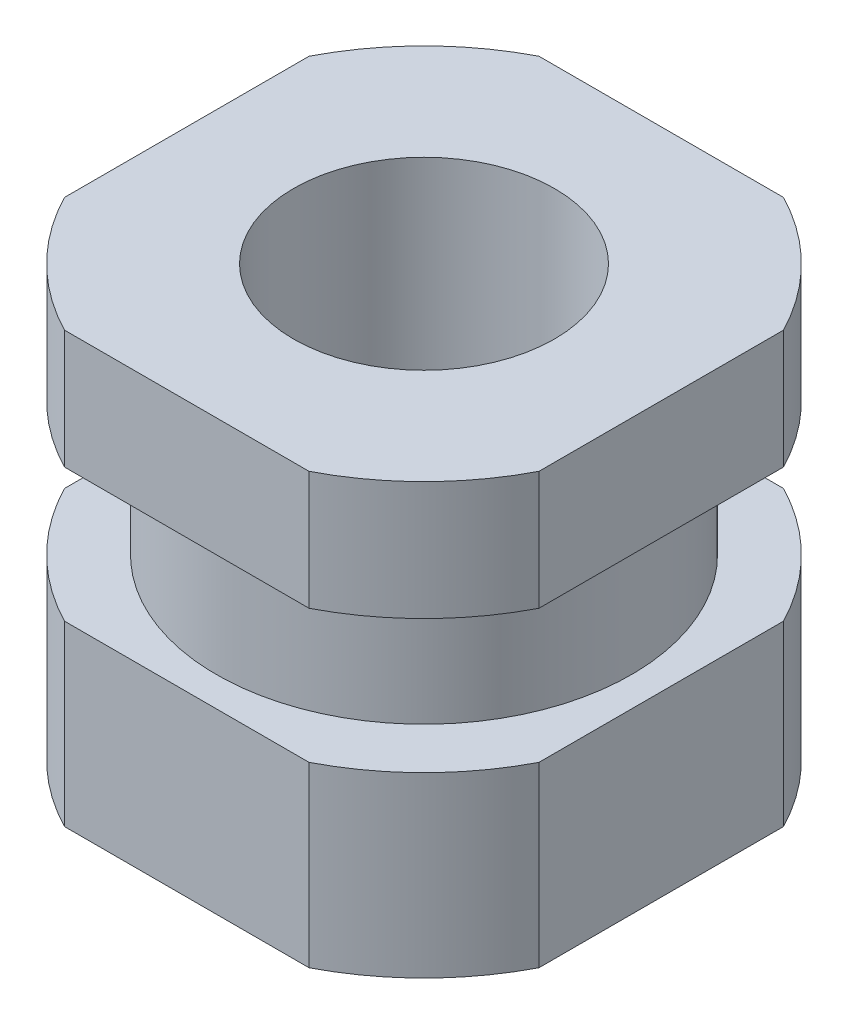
ISO-10303-21;
HEADER;
FILE_DESCRIPTION(('STEP AP214'),'2;1');
FILE_NAME('part.step','',(''),(''),'','','');
FILE_SCHEMA(('AUTOMOTIVE_DESIGN { 1 0 10303 214 1 1 1 1 }'));
ENDSEC;
DATA;
#1=APPLICATION_CONTEXT('core data for automotive mechanical design processes');
#2=APPLICATION_PROTOCOL_DEFINITION('international standard','automotive_design',2000,#1);
#3=PRODUCT_CONTEXT('',#1,'mechanical');
#4=PRODUCT('Part','Part','',(#3));
#5=PRODUCT_RELATED_PRODUCT_CATEGORY('part','',(#4));
#6=PRODUCT_DEFINITION_FORMATION('','',#4);
#7=PRODUCT_DEFINITION_CONTEXT('part definition',#1,'design');
#8=PRODUCT_DEFINITION('design','',#6,#7);
#9=PRODUCT_DEFINITION_SHAPE('','',#8);
#10=(LENGTH_UNIT() NAMED_UNIT(*) SI_UNIT(.MILLI.,.METRE.));
#11=(NAMED_UNIT(*) PLANE_ANGLE_UNIT() SI_UNIT($,.RADIAN.));
#12=(NAMED_UNIT(*) SI_UNIT($,.STERADIAN.) SOLID_ANGLE_UNIT());
#13=UNCERTAINTY_MEASURE_WITH_UNIT(LENGTH_MEASURE(1.E-05),#10,'distance_accuracy_value','');
#14=(GEOMETRIC_REPRESENTATION_CONTEXT(3) GLOBAL_UNCERTAINTY_ASSIGNED_CONTEXT((#13)) GLOBAL_UNIT_ASSIGNED_CONTEXT((#10,
#11,#12)) REPRESENTATION_CONTEXT('',''));
#15=CARTESIAN_POINT('',(0.,0.,0.));
#16=DIRECTION('',(0.,0.,1.));
#17=DIRECTION('',(1.,0.,0.));
#18=AXIS2_PLACEMENT_3D('',#15,#16,#17);
#19=CARTESIAN_POINT('',(37.,48.1125258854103,0.));
#20=DIRECTION('',(0.,1.,0.));
#21=DIRECTION('',(0.,0.,1.));
#22=AXIS2_PLACEMENT_3D('',#19,#20,#21);
#23=PLANE('',#22);
#24=CARTESIAN_POINT('',(37.,48.1125258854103,0.));
#25=DIRECTION('',(0.,1.,0.));
#26=DIRECTION('',(0.,0.,1.));
#27=AXIS2_PLACEMENT_3D('',#24,#25,#26);
#28=CIRCLE('',#27,4.4);
#29=CARTESIAN_POINT('',(37.,48.1125258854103,4.4));
#30=VERTEX_POINT('',#29);
#31=EDGE_CURVE('E164',#30,#30,#28,.T.);
#32=ORIENTED_EDGE('',*,*,#31,.T.);
#33=EDGE_LOOP('',(#32));
#34=FACE_BOUND('',#33,.T.);
#35=DIRECTION('',(0.,0.,-1.));
#36=VECTOR('',#35,1.);
#37=CARTESIAN_POINT('',(45.,48.1125258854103,0.));
#38=LINE('',#37,#36);
#39=CARTESIAN_POINT('',(45.,48.1125258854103,4.12310562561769));
#40=VERTEX_POINT('',#39);
#41=CARTESIAN_POINT('',(45.,48.1125258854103,-4.12310562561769));
#42=VERTEX_POINT('',#41);
#43=EDGE_CURVE('E173',#40,#42,#38,.T.);
#44=ORIENTED_EDGE('',*,*,#43,.F.);
#45=CARTESIAN_POINT('',(37.,48.1125258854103,0.));
#46=DIRECTION('',(0.,-1.,0.));
#47=DIRECTION('',(0.,0.,-1.));
#48=AXIS2_PLACEMENT_3D('',#45,#46,#47);
#49=CIRCLE('',#48,9.);
#50=CARTESIAN_POINT('',(41.1231056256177,48.1125258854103,8.));
#51=VERTEX_POINT('',#50);
#52=EDGE_CURVE('E245',#40,#51,#49,.T.);
#53=ORIENTED_EDGE('',*,*,#52,.T.);
#54=DIRECTION('',(1.,0.,0.));
#55=VECTOR('',#54,1.);
#56=CARTESIAN_POINT('',(37.,48.1125258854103,8.));
#57=LINE('',#56,#55);
#58=CARTESIAN_POINT('',(32.8768943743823,48.1125258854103,8.));
#59=VERTEX_POINT('',#58);
#60=EDGE_CURVE('E189',#59,#51,#57,.T.);
#61=ORIENTED_EDGE('',*,*,#60,.F.);
#62=CARTESIAN_POINT('',(29.,48.1125258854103,4.12310562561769));
#63=VERTEX_POINT('',#62);
#64=EDGE_CURVE('E306',#59,#63,#49,.T.);
#65=ORIENTED_EDGE('',*,*,#64,.T.);
#66=DIRECTION('',(0.,0.,1.));
#67=VECTOR('',#66,1.);
#68=CARTESIAN_POINT('',(29.,48.1125258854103,0.));
#69=LINE('',#68,#67);
#70=CARTESIAN_POINT('',(29.,48.1125258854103,-4.12310562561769));
#71=VERTEX_POINT('',#70);
#72=EDGE_CURVE('E203',#71,#63,#69,.T.);
#73=ORIENTED_EDGE('',*,*,#72,.F.);
#74=CARTESIAN_POINT('',(32.8768943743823,48.1125258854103,-8.));
#75=VERTEX_POINT('',#74);
#76=EDGE_CURVE('E246',#71,#75,#49,.T.);
#77=ORIENTED_EDGE('',*,*,#76,.T.);
#78=DIRECTION('',(-1.,0.,0.));
#79=VECTOR('',#78,1.);
#80=CARTESIAN_POINT('',(37.,48.1125258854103,-8.));
#81=LINE('',#80,#79);
#82=CARTESIAN_POINT('',(41.1231056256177,48.1125258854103,-8.));
#83=VERTEX_POINT('',#82);
#84=EDGE_CURVE('E216',#83,#75,#81,.T.);
#85=ORIENTED_EDGE('',*,*,#84,.F.);
#86=EDGE_CURVE('E138',#83,#42,#49,.T.);
#87=ORIENTED_EDGE('',*,*,#86,.T.);
#88=EDGE_LOOP('',(#44,#53,#61,#65,#73,#77,#85,#87));
#89=FACE_BOUND('',#88,.T.);
#90=ADVANCED_FACE('F16',(#34,#89),#23,.F.);
#91=CARTESIAN_POINT('',(37.,48.1125258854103,0.));
#92=DIRECTION('',(0.,-1.,0.));
#93=DIRECTION('',(0.,0.,-1.));
#94=AXIS2_PLACEMENT_3D('',#91,#92,#93);
#95=CYLINDRICAL_SURFACE('',#94,9.);
#96=DIRECTION('',(0.,-1.,0.));
#97=VECTOR('',#96,1.);
#98=CARTESIAN_POINT('',(45.,48.1125258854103,4.12310562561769));
#99=LINE('',#98,#97);
#100=CARTESIAN_POINT('',(45.,54.1125258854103,4.12310562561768));
#101=VERTEX_POINT('',#100);
#102=EDGE_CURVE('E177',#101,#40,#99,.T.);
#103=ORIENTED_EDGE('',*,*,#102,.F.);
#104=CARTESIAN_POINT('',(37.,54.1125258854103,0.));
#105=DIRECTION('',(0.,-1.,0.));
#106=DIRECTION('',(0.,0.,-1.));
#107=AXIS2_PLACEMENT_3D('',#104,#105,#106);
#108=CIRCLE('',#107,9.);
#109=CARTESIAN_POINT('',(41.1231056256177,54.1125258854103,8.));
#110=VERTEX_POINT('',#109);
#111=EDGE_CURVE('E250',#101,#110,#108,.T.);
#112=ORIENTED_EDGE('',*,*,#111,.T.);
#113=DIRECTION('',(0.,-1.,0.));
#114=VECTOR('',#113,1.);
#115=CARTESIAN_POINT('',(41.1231056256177,48.1125258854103,8.));
#116=LINE('',#115,#114);
#117=EDGE_CURVE('E193',#51,#110,#116,.F.);
#118=ORIENTED_EDGE('',*,*,#117,.F.);
#119=ORIENTED_EDGE('',*,*,#52,.F.);
#120=EDGE_LOOP('',(#103,#112,#118,#119));
#121=FACE_BOUND('',#120,.T.);
#122=ADVANCED_FACE('F285',(#121),#95,.T.);
#123=DIRECTION('',(0.,-1.,0.));
#124=VECTOR('',#123,1.);
#125=CARTESIAN_POINT('',(45.,48.1125258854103,-4.12310562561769));
#126=LINE('',#125,#124);
#127=CARTESIAN_POINT('',(45.,54.1125258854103,-4.12310562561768));
#128=VERTEX_POINT('',#127);
#129=EDGE_CURVE('E179',#42,#128,#126,.F.);
#130=ORIENTED_EDGE('',*,*,#129,.F.);
#131=ORIENTED_EDGE('',*,*,#86,.F.);
#132=DIRECTION('',(0.,-1.,0.));
#133=VECTOR('',#132,1.);
#134=CARTESIAN_POINT('',(41.1231056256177,48.1125258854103,-8.));
#135=LINE('',#134,#133);
#136=CARTESIAN_POINT('',(41.1231056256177,54.1125258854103,-8.));
#137=VERTEX_POINT('',#136);
#138=EDGE_CURVE('E218',#137,#83,#135,.T.);
#139=ORIENTED_EDGE('',*,*,#138,.F.);
#140=EDGE_CURVE('E247',#137,#128,#108,.T.);
#141=ORIENTED_EDGE('',*,*,#140,.T.);
#142=EDGE_LOOP('',(#130,#131,#139,#141));
#143=FACE_BOUND('',#142,.T.);
#144=ADVANCED_FACE('F290',(#143),#95,.T.);
#145=DIRECTION('',(0.,-1.,0.));
#146=VECTOR('',#145,1.);
#147=CARTESIAN_POINT('',(32.8768943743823,48.1125258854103,8.));
#148=LINE('',#147,#146);
#149=CARTESIAN_POINT('',(32.8768943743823,54.1125258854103,8.));
#150=VERTEX_POINT('',#149);
#151=EDGE_CURVE('E191',#150,#59,#148,.T.);
#152=ORIENTED_EDGE('',*,*,#151,.F.);
#153=CARTESIAN_POINT('',(29.,54.1125258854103,4.12310562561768));
#154=VERTEX_POINT('',#153);
#155=EDGE_CURVE('E317',#150,#154,#108,.T.);
#156=ORIENTED_EDGE('',*,*,#155,.T.);
#157=DIRECTION('',(0.,-1.,0.));
#158=VECTOR('',#157,1.);
#159=CARTESIAN_POINT('',(29.,48.1125258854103,4.12310562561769));
#160=LINE('',#159,#158);
#161=EDGE_CURVE('E38',#63,#154,#160,.F.);
#162=ORIENTED_EDGE('',*,*,#161,.F.);
#163=ORIENTED_EDGE('',*,*,#64,.F.);
#164=EDGE_LOOP('',(#152,#156,#162,#163));
#165=FACE_BOUND('',#164,.T.);
#166=ADVANCED_FACE('F326',(#165),#95,.T.);
#167=DIRECTION('',(0.,-1.,0.));
#168=VECTOR('',#167,1.);
#169=CARTESIAN_POINT('',(29.,48.1125258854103,-4.12310562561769));
#170=LINE('',#169,#168);
#171=CARTESIAN_POINT('',(29.,54.1125258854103,-4.12310562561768));
#172=VERTEX_POINT('',#171);
#173=EDGE_CURVE('E205',#172,#71,#170,.T.);
#174=ORIENTED_EDGE('',*,*,#173,.F.);
#175=CARTESIAN_POINT('',(32.8768943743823,54.1125258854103,-8.));
#176=VERTEX_POINT('',#175);
#177=EDGE_CURVE('E251',#172,#176,#108,.T.);
#178=ORIENTED_EDGE('',*,*,#177,.T.);
#179=DIRECTION('',(0.,-1.,0.));
#180=VECTOR('',#179,1.);
#181=CARTESIAN_POINT('',(32.8768943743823,48.1125258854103,-8.));
#182=LINE('',#181,#180);
#183=EDGE_CURVE('E30',#75,#176,#182,.F.);
#184=ORIENTED_EDGE('',*,*,#183,.F.);
#185=ORIENTED_EDGE('',*,*,#76,.F.);
#186=EDGE_LOOP('',(#174,#178,#184,#185));
#187=FACE_BOUND('',#186,.T.);
#188=ADVANCED_FACE('F292',(#187),#95,.T.);
#189=CARTESIAN_POINT('',(28.,54.1125258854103,0.));
#190=DIRECTION('',(0.,-1.,0.));
#191=DIRECTION('',(0.,0.,-1.));
#192=AXIS2_PLACEMENT_3D('',#189,#190,#191);
#193=PLANE('',#192);
#194=CARTESIAN_POINT('',(37.,54.1125258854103,0.));
#195=DIRECTION('',(0.,-1.,0.));
#196=DIRECTION('',(0.,0.,-1.));
#197=AXIS2_PLACEMENT_3D('',#194,#195,#196);
#198=CIRCLE('',#197,7.);
#199=CARTESIAN_POINT('',(37.,54.1125258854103,-7.));
#200=VERTEX_POINT('',#199);
#201=EDGE_CURVE('E252',#200,#200,#198,.T.);
#202=ORIENTED_EDGE('',*,*,#201,.T.);
#203=EDGE_LOOP('',(#202));
#204=FACE_BOUND('',#203,.T.);
#205=DIRECTION('',(0.,0.,1.));
#206=VECTOR('',#205,1.);
#207=CARTESIAN_POINT('',(45.,54.1125258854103,0.));
#208=LINE('',#207,#206);
#209=EDGE_CURVE('E181',#128,#101,#208,.T.);
#210=ORIENTED_EDGE('',*,*,#209,.F.);
#211=ORIENTED_EDGE('',*,*,#140,.F.);
#212=DIRECTION('',(1.,0.,0.));
#213=VECTOR('',#212,1.);
#214=CARTESIAN_POINT('',(28.,54.1125258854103,-8.));
#215=LINE('',#214,#213);
#216=EDGE_CURVE('E148',#176,#137,#215,.T.);
#217=ORIENTED_EDGE('',*,*,#216,.F.);
#218=ORIENTED_EDGE('',*,*,#177,.F.);
#219=DIRECTION('',(0.,0.,-1.));
#220=VECTOR('',#219,1.);
#221=CARTESIAN_POINT('',(29.,54.1125258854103,0.));
#222=LINE('',#221,#220);
#223=EDGE_CURVE('E208',#154,#172,#222,.T.);
#224=ORIENTED_EDGE('',*,*,#223,.F.);
#225=ORIENTED_EDGE('',*,*,#155,.F.);
#226=DIRECTION('',(-1.,0.,0.));
#227=VECTOR('',#226,1.);
#228=CARTESIAN_POINT('',(28.,54.1125258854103,8.));
#229=LINE('',#228,#227);
#230=EDGE_CURVE('E195',#110,#150,#229,.T.);
#231=ORIENTED_EDGE('',*,*,#230,.F.);
#232=ORIENTED_EDGE('',*,*,#111,.F.);
#233=EDGE_LOOP('',(#210,#211,#217,#218,#224,#225,#231,#232));
#234=FACE_BOUND('',#233,.T.);
#235=ADVANCED_FACE('F324',(#204,#234),#193,.F.);
#236=CARTESIAN_POINT('',(30.,58.6125258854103,0.));
#237=DIRECTION('',(0.,1.,0.));
#238=DIRECTION('',(0.,0.,1.));
#239=AXIS2_PLACEMENT_3D('',#236,#237,#238);
#240=PLANE('',#239);
#241=CARTESIAN_POINT('',(37.,58.6125258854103,0.));
#242=DIRECTION('',(0.,-1.,0.));
#243=DIRECTION('',(0.,0.,-1.));
#244=AXIS2_PLACEMENT_3D('',#241,#242,#243);
#245=CIRCLE('',#244,7.);
#246=CARTESIAN_POINT('',(37.,58.6125258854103,-7.));
#247=VERTEX_POINT('',#246);
#248=EDGE_CURVE('E255',#247,#247,#245,.T.);
#249=ORIENTED_EDGE('',*,*,#248,.F.);
#250=EDGE_LOOP('',(#249));
#251=FACE_BOUND('',#250,.T.);
#252=DIRECTION('',(0.,0.,-1.));
#253=VECTOR('',#252,1.);
#254=CARTESIAN_POINT('',(45.,58.6125258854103,0.));
#255=LINE('',#254,#253);
#256=CARTESIAN_POINT('',(45.,58.6125258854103,4.12310562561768));
#257=VERTEX_POINT('',#256);
#258=CARTESIAN_POINT('',(45.,58.6125258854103,-4.12310562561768));
#259=VERTEX_POINT('',#258);
#260=EDGE_CURVE('E185',#257,#259,#255,.T.);
#261=ORIENTED_EDGE('',*,*,#260,.F.);
#262=CARTESIAN_POINT('',(37.,58.6125258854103,0.));
#263=DIRECTION('',(0.,-1.,0.));
#264=DIRECTION('',(0.,0.,-1.));
#265=AXIS2_PLACEMENT_3D('',#262,#263,#264);
#266=CIRCLE('',#265,9.);
#267=CARTESIAN_POINT('',(41.1231056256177,58.6125258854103,8.));
#268=VERTEX_POINT('',#267);
#269=EDGE_CURVE('E257',#257,#268,#266,.T.);
#270=ORIENTED_EDGE('',*,*,#269,.T.);
#271=DIRECTION('',(1.,0.,0.));
#272=VECTOR('',#271,1.);
#273=CARTESIAN_POINT('',(30.,58.6125258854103,8.));
#274=LINE('',#273,#272);
#275=CARTESIAN_POINT('',(32.8768943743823,58.6125258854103,8.));
#276=VERTEX_POINT('',#275);
#277=EDGE_CURVE('E199',#276,#268,#274,.T.);
#278=ORIENTED_EDGE('',*,*,#277,.F.);
#279=CARTESIAN_POINT('',(29.,58.6125258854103,4.12310562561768));
#280=VERTEX_POINT('',#279);
#281=EDGE_CURVE('E159',#276,#280,#266,.T.);
#282=ORIENTED_EDGE('',*,*,#281,.T.);
#283=DIRECTION('',(0.,0.,1.));
#284=VECTOR('',#283,1.);
#285=CARTESIAN_POINT('',(29.,58.6125258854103,0.));
#286=LINE('',#285,#284);
#287=CARTESIAN_POINT('',(29.,58.6125258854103,-4.12310562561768));
#288=VERTEX_POINT('',#287);
#289=EDGE_CURVE('E212',#288,#280,#286,.T.);
#290=ORIENTED_EDGE('',*,*,#289,.F.);
#291=CARTESIAN_POINT('',(32.8768943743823,58.6125258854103,-8.));
#292=VERTEX_POINT('',#291);
#293=EDGE_CURVE('E154',#288,#292,#266,.T.);
#294=ORIENTED_EDGE('',*,*,#293,.T.);
#295=DIRECTION('',(-1.,0.,0.));
#296=VECTOR('',#295,1.);
#297=CARTESIAN_POINT('',(30.,58.6125258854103,-8.));
#298=LINE('',#297,#296);
#299=CARTESIAN_POINT('',(41.1231056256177,58.6125258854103,-8.));
#300=VERTEX_POINT('',#299);
#301=EDGE_CURVE('E149',#300,#292,#298,.T.);
#302=ORIENTED_EDGE('',*,*,#301,.F.);
#303=EDGE_CURVE('E147',#300,#259,#266,.T.);
#304=ORIENTED_EDGE('',*,*,#303,.T.);
#305=EDGE_LOOP('',(#261,#270,#278,#282,#290,#294,#302,#304));
#306=FACE_BOUND('',#305,.T.);
#307=ADVANCED_FACE('F228',(#251,#306),#240,.F.);
#308=CARTESIAN_POINT('',(37.,48.1125258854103,0.));
#309=DIRECTION('',(0.,-1.,0.));
#310=DIRECTION('',(0.,0.,-1.));
#311=AXIS2_PLACEMENT_3D('',#308,#309,#310);
#312=CYLINDRICAL_SURFACE('',#311,9.);
#313=DIRECTION('',(0.,-1.,0.));
#314=VECTOR('',#313,1.);
#315=CARTESIAN_POINT('',(45.,48.1125258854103,4.12310562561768));
#316=LINE('',#315,#314);
#317=CARTESIAN_POINT('',(45.,62.6125258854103,4.12310562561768));
#318=VERTEX_POINT('',#317);
#319=EDGE_CURVE('E183',#318,#257,#316,.T.);
#320=ORIENTED_EDGE('',*,*,#319,.F.);
#321=CARTESIAN_POINT('',(37.,62.6125258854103,0.));
#322=DIRECTION('',(0.,-1.,0.));
#323=DIRECTION('',(0.,0.,-1.));
#324=AXIS2_PLACEMENT_3D('',#321,#322,#323);
#325=CIRCLE('',#324,9.);
#326=CARTESIAN_POINT('',(41.1231056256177,62.6125258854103,8.));
#327=VERTEX_POINT('',#326);
#328=EDGE_CURVE('E155',#318,#327,#325,.T.);
#329=ORIENTED_EDGE('',*,*,#328,.T.);
#330=DIRECTION('',(0.,-1.,0.));
#331=VECTOR('',#330,1.);
#332=CARTESIAN_POINT('',(41.1231056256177,48.1125258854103,8.));
#333=LINE('',#332,#331);
#334=EDGE_CURVE('E201',#268,#327,#333,.F.);
#335=ORIENTED_EDGE('',*,*,#334,.F.);
#336=ORIENTED_EDGE('',*,*,#269,.F.);
#337=EDGE_LOOP('',(#320,#329,#335,#336));
#338=FACE_BOUND('',#337,.T.);
#339=ADVANCED_FACE('F263',(#338),#312,.T.);
#340=DIRECTION('',(0.,-1.,0.));
#341=VECTOR('',#340,1.);
#342=CARTESIAN_POINT('',(45.,48.1125258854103,-4.12310562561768));
#343=LINE('',#342,#341);
#344=CARTESIAN_POINT('',(45.,62.6125258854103,-4.12310562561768));
#345=VERTEX_POINT('',#344);
#346=EDGE_CURVE('E187',#259,#345,#343,.F.);
#347=ORIENTED_EDGE('',*,*,#346,.F.);
#348=ORIENTED_EDGE('',*,*,#303,.F.);
#349=DIRECTION('',(0.,-1.,0.));
#350=VECTOR('',#349,1.);
#351=CARTESIAN_POINT('',(41.1231056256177,48.1125258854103,-8.));
#352=LINE('',#351,#350);
#353=CARTESIAN_POINT('',(41.1231056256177,62.6125258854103,-8.));
#354=VERTEX_POINT('',#353);
#355=EDGE_CURVE('E129',#354,#300,#352,.T.);
#356=ORIENTED_EDGE('',*,*,#355,.F.);
#357=EDGE_CURVE('E145',#354,#345,#325,.T.);
#358=ORIENTED_EDGE('',*,*,#357,.T.);
#359=EDGE_LOOP('',(#347,#348,#356,#358));
#360=FACE_BOUND('',#359,.T.);
#361=ADVANCED_FACE('F144',(#360),#312,.T.);
#362=DIRECTION('',(0.,-1.,0.));
#363=VECTOR('',#362,1.);
#364=CARTESIAN_POINT('',(32.8768943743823,48.1125258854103,8.));
#365=LINE('',#364,#363);
#366=CARTESIAN_POINT('',(32.8768943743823,62.6125258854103,8.));
#367=VERTEX_POINT('',#366);
#368=EDGE_CURVE('E197',#367,#276,#365,.T.);
#369=ORIENTED_EDGE('',*,*,#368,.F.);
#370=CARTESIAN_POINT('',(29.,62.6125258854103,4.12310562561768));
#371=VERTEX_POINT('',#370);
#372=EDGE_CURVE('E162',#367,#371,#325,.T.);
#373=ORIENTED_EDGE('',*,*,#372,.T.);
#374=DIRECTION('',(0.,-1.,0.));
#375=VECTOR('',#374,1.);
#376=CARTESIAN_POINT('',(29.,48.1125258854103,4.12310562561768));
#377=LINE('',#376,#375);
#378=EDGE_CURVE('E214',#280,#371,#377,.F.);
#379=ORIENTED_EDGE('',*,*,#378,.F.);
#380=ORIENTED_EDGE('',*,*,#281,.F.);
#381=EDGE_LOOP('',(#369,#373,#379,#380));
#382=FACE_BOUND('',#381,.T.);
#383=ADVANCED_FACE('F238',(#382),#312,.T.);
#384=DIRECTION('',(0.,-1.,0.));
#385=VECTOR('',#384,1.);
#386=CARTESIAN_POINT('',(29.,48.1125258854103,-4.12310562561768));
#387=LINE('',#386,#385);
#388=CARTESIAN_POINT('',(29.,62.6125258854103,-4.12310562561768));
#389=VERTEX_POINT('',#388);
#390=EDGE_CURVE('E210',#389,#288,#387,.T.);
#391=ORIENTED_EDGE('',*,*,#390,.F.);
#392=CARTESIAN_POINT('',(32.8768943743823,62.6125258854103,-8.));
#393=VERTEX_POINT('',#392);
#394=EDGE_CURVE('E157',#389,#393,#325,.T.);
#395=ORIENTED_EDGE('',*,*,#394,.T.);
#396=DIRECTION('',(0.,-1.,0.));
#397=VECTOR('',#396,1.);
#398=CARTESIAN_POINT('',(32.8768943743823,48.1125258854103,-8.));
#399=LINE('',#398,#397);
#400=EDGE_CURVE('E132',#292,#393,#399,.F.);
#401=ORIENTED_EDGE('',*,*,#400,.F.);
#402=ORIENTED_EDGE('',*,*,#293,.F.);
#403=EDGE_LOOP('',(#391,#395,#401,#402));
#404=FACE_BOUND('',#403,.T.);
#405=ADVANCED_FACE('F225',(#404),#312,.T.);
#406=CARTESIAN_POINT('',(28.,62.6125258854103,0.));
#407=DIRECTION('',(0.,-1.,0.));
#408=DIRECTION('',(0.,0.,-1.));
#409=AXIS2_PLACEMENT_3D('',#406,#407,#408);
#410=PLANE('',#409);
#411=CARTESIAN_POINT('',(37.,62.6125258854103,0.));
#412=DIRECTION('',(0.,1.,0.));
#413=DIRECTION('',(0.,0.,1.));
#414=AXIS2_PLACEMENT_3D('',#411,#412,#413);
#415=CIRCLE('',#414,4.4);
#416=CARTESIAN_POINT('',(37.,62.6125258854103,4.4));
#417=VERTEX_POINT('',#416);
#418=EDGE_CURVE('E169',#417,#417,#415,.T.);
#419=ORIENTED_EDGE('',*,*,#418,.F.);
#420=EDGE_LOOP('',(#419));
#421=FACE_BOUND('',#420,.T.);
#422=DIRECTION('',(0.,0.,1.));
#423=VECTOR('',#422,1.);
#424=CARTESIAN_POINT('',(45.,62.6125258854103,0.));
#425=LINE('',#424,#423);
#426=EDGE_CURVE('E11',#345,#318,#425,.T.);
#427=ORIENTED_EDGE('',*,*,#426,.F.);
#428=ORIENTED_EDGE('',*,*,#357,.F.);
#429=DIRECTION('',(1.,0.,0.));
#430=VECTOR('',#429,1.);
#431=CARTESIAN_POINT('',(28.,62.6125258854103,-8.));
#432=LINE('',#431,#430);
#433=EDGE_CURVE('E126',#393,#354,#432,.T.);
#434=ORIENTED_EDGE('',*,*,#433,.F.);
#435=ORIENTED_EDGE('',*,*,#394,.F.);
#436=DIRECTION('',(0.,0.,-1.));
#437=VECTOR('',#436,1.);
#438=CARTESIAN_POINT('',(29.,62.6125258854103,0.));
#439=LINE('',#438,#437);
#440=EDGE_CURVE('E137',#371,#389,#439,.T.);
#441=ORIENTED_EDGE('',*,*,#440,.F.);
#442=ORIENTED_EDGE('',*,*,#372,.F.);
#443=DIRECTION('',(-1.,0.,0.));
#444=VECTOR('',#443,1.);
#445=CARTESIAN_POINT('',(28.,62.6125258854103,8.));
#446=LINE('',#445,#444);
#447=EDGE_CURVE('E23',#327,#367,#446,.T.);
#448=ORIENTED_EDGE('',*,*,#447,.F.);
#449=ORIENTED_EDGE('',*,*,#328,.F.);
#450=EDGE_LOOP('',(#427,#428,#434,#435,#441,#442,#448,#449));
#451=FACE_BOUND('',#450,.T.);
#452=ADVANCED_FACE('F152',(#421,#451),#410,.F.);
#453=CARTESIAN_POINT('',(37.,48.1125258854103,0.));
#454=DIRECTION('',(0.,-1.,0.));
#455=DIRECTION('',(0.,0.,-1.));
#456=AXIS2_PLACEMENT_3D('',#453,#454,#455);
#457=CYLINDRICAL_SURFACE('',#456,7.);
#458=ORIENTED_EDGE('',*,*,#201,.F.);
#459=EDGE_LOOP('',(#458));
#460=FACE_BOUND('',#459,.T.);
#461=ORIENTED_EDGE('',*,*,#248,.T.);
#462=EDGE_LOOP('',(#461));
#463=FACE_BOUND('',#462,.T.);
#464=ADVANCED_FACE('F338',(#460,#463),#457,.T.);
#465=CARTESIAN_POINT('',(37.,62.6125258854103,0.));
#466=DIRECTION('',(0.,1.,0.));
#467=DIRECTION('',(0.,0.,1.));
#468=AXIS2_PLACEMENT_3D('',#465,#466,#467);
#469=CYLINDRICAL_SURFACE('',#468,4.4);
#470=ORIENTED_EDGE('',*,*,#31,.F.);
#471=EDGE_LOOP('',(#470));
#472=FACE_BOUND('',#471,.T.);
#473=ORIENTED_EDGE('',*,*,#418,.T.);
#474=EDGE_LOOP('',(#473));
#475=FACE_BOUND('',#474,.T.);
#476=ADVANCED_FACE('F341',(#472,#475),#469,.F.);
#477=CARTESIAN_POINT('',(29.,-37.3874741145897,-8.));
#478=DIRECTION('',(0.,0.,-1.));
#479=DIRECTION('',(-1.,0.,0.));
#480=AXIS2_PLACEMENT_3D('',#477,#478,#479);
#481=PLANE('',#480);
#482=ORIENTED_EDGE('',*,*,#355,.T.);
#483=ORIENTED_EDGE('',*,*,#301,.T.);
#484=ORIENTED_EDGE('',*,*,#400,.T.);
#485=ORIENTED_EDGE('',*,*,#433,.T.);
#486=EDGE_LOOP('',(#482,#483,#484,#485));
#487=FACE_BOUND('',#486,.T.);
#488=ADVANCED_FACE('F128',(#487),#481,.T.);
#489=CARTESIAN_POINT('',(29.,-37.3874741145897,8.));
#490=DIRECTION('',(-1.,0.,0.));
#491=DIRECTION('',(0.,0.,1.));
#492=AXIS2_PLACEMENT_3D('',#489,#490,#491);
#493=PLANE('',#492);
#494=ORIENTED_EDGE('',*,*,#390,.T.);
#495=ORIENTED_EDGE('',*,*,#289,.T.);
#496=ORIENTED_EDGE('',*,*,#378,.T.);
#497=ORIENTED_EDGE('',*,*,#440,.T.);
#498=EDGE_LOOP('',(#494,#495,#496,#497));
#499=FACE_BOUND('',#498,.T.);
#500=ADVANCED_FACE('F234',(#499),#493,.T.);
#501=CARTESIAN_POINT('',(29.,-37.3874741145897,8.));
#502=DIRECTION('',(0.,0.,1.));
#503=DIRECTION('',(1.,0.,0.));
#504=AXIS2_PLACEMENT_3D('',#501,#502,#503);
#505=PLANE('',#504);
#506=ORIENTED_EDGE('',*,*,#368,.T.);
#507=ORIENTED_EDGE('',*,*,#277,.T.);
#508=ORIENTED_EDGE('',*,*,#334,.T.);
#509=ORIENTED_EDGE('',*,*,#447,.T.);
#510=EDGE_LOOP('',(#506,#507,#508,#509));
#511=FACE_BOUND('',#510,.T.);
#512=ADVANCED_FACE('F265',(#511),#505,.T.);
#513=CARTESIAN_POINT('',(45.,-37.3874741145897,8.));
#514=DIRECTION('',(1.,0.,0.));
#515=DIRECTION('',(0.,0.,-1.));
#516=AXIS2_PLACEMENT_3D('',#513,#514,#515);
#517=PLANE('',#516);
#518=ORIENTED_EDGE('',*,*,#319,.T.);
#519=ORIENTED_EDGE('',*,*,#260,.T.);
#520=ORIENTED_EDGE('',*,*,#346,.T.);
#521=ORIENTED_EDGE('',*,*,#426,.T.);
#522=EDGE_LOOP('',(#518,#519,#520,#521));
#523=FACE_BOUND('',#522,.T.);
#524=ADVANCED_FACE('F267',(#523),#517,.T.);
#525=ORIENTED_EDGE('',*,*,#84,.T.);
#526=ORIENTED_EDGE('',*,*,#183,.T.);
#527=ORIENTED_EDGE('',*,*,#216,.T.);
#528=ORIENTED_EDGE('',*,*,#138,.T.);
#529=EDGE_LOOP('',(#525,#526,#527,#528));
#530=FACE_BOUND('',#529,.T.);
#531=ADVANCED_FACE('F276',(#530),#481,.T.);
#532=ORIENTED_EDGE('',*,*,#72,.T.);
#533=ORIENTED_EDGE('',*,*,#161,.T.);
#534=ORIENTED_EDGE('',*,*,#223,.T.);
#535=ORIENTED_EDGE('',*,*,#173,.T.);
#536=EDGE_LOOP('',(#532,#533,#534,#535));
#537=FACE_BOUND('',#536,.T.);
#538=ADVANCED_FACE('F281',(#537),#493,.T.);
#539=ORIENTED_EDGE('',*,*,#60,.T.);
#540=ORIENTED_EDGE('',*,*,#117,.T.);
#541=ORIENTED_EDGE('',*,*,#230,.T.);
#542=ORIENTED_EDGE('',*,*,#151,.T.);
#543=EDGE_LOOP('',(#539,#540,#541,#542));
#544=FACE_BOUND('',#543,.T.);
#545=ADVANCED_FACE('F269',(#544),#505,.T.);
#546=ORIENTED_EDGE('',*,*,#43,.T.);
#547=ORIENTED_EDGE('',*,*,#129,.T.);
#548=ORIENTED_EDGE('',*,*,#209,.T.);
#549=ORIENTED_EDGE('',*,*,#102,.T.);
#550=EDGE_LOOP('',(#546,#547,#548,#549));
#551=FACE_BOUND('',#550,.T.);
#552=ADVANCED_FACE('F279',(#551),#517,.T.);
#553=CLOSED_SHELL('',(#90,#122,#144,#166,#188,#235,#307,#339,#361,#383,#405,#452,#464,#476,#488,
#500,#512,#524,#531,#538,#545,#552));
#554=MANIFOLD_SOLID_BREP('B1',#553);
#555=ADVANCED_BREP_SHAPE_REPRESENTATION('',(#18,#554),#14);
#556=SHAPE_DEFINITION_REPRESENTATION(#9,#555);
ENDSEC;
END-ISO-10303-21;
